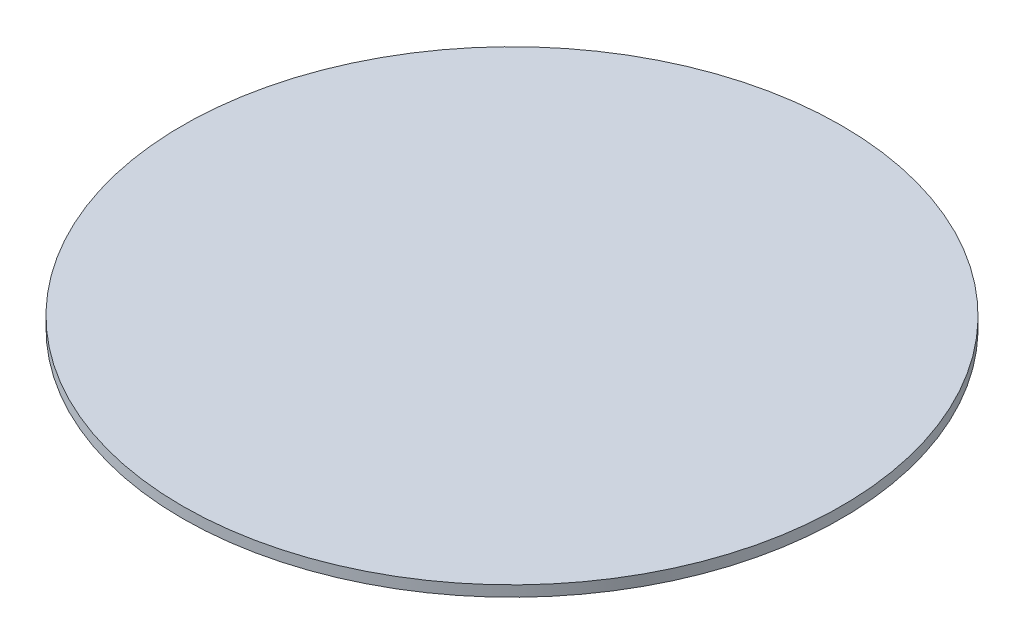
ISO-10303-21;
HEADER;
FILE_DESCRIPTION(('STEP AP214'),'2;1');
FILE_NAME('part.step','',(''),(''),'','','');
FILE_SCHEMA(('AUTOMOTIVE_DESIGN { 1 0 10303 214 1 1 1 1 }'));
ENDSEC;
DATA;
#1=APPLICATION_CONTEXT('core data for automotive mechanical design processes');
#2=APPLICATION_PROTOCOL_DEFINITION('international standard','automotive_design',2000,#1);
#3=PRODUCT_CONTEXT('',#1,'mechanical');
#4=PRODUCT('Part','Part','',(#3));
#5=PRODUCT_RELATED_PRODUCT_CATEGORY('part','',(#4));
#6=PRODUCT_DEFINITION_FORMATION('','',#4);
#7=PRODUCT_DEFINITION_CONTEXT('part definition',#1,'design');
#8=PRODUCT_DEFINITION('design','',#6,#7);
#9=PRODUCT_DEFINITION_SHAPE('','',#8);
#10=(LENGTH_UNIT() NAMED_UNIT(*) SI_UNIT(.MILLI.,.METRE.));
#11=(NAMED_UNIT(*) PLANE_ANGLE_UNIT() SI_UNIT($,.RADIAN.));
#12=(NAMED_UNIT(*) SI_UNIT($,.STERADIAN.) SOLID_ANGLE_UNIT());
#13=UNCERTAINTY_MEASURE_WITH_UNIT(LENGTH_MEASURE(1.E-05),#10,'distance_accuracy_value','');
#14=(GEOMETRIC_REPRESENTATION_CONTEXT(3) GLOBAL_UNCERTAINTY_ASSIGNED_CONTEXT((#13)) GLOBAL_UNIT_ASSIGNED_CONTEXT((#10,
#11,#12)) REPRESENTATION_CONTEXT('',''));
#15=CARTESIAN_POINT('',(0.,0.,0.));
#16=DIRECTION('',(0.,0.,1.));
#17=DIRECTION('',(1.,0.,0.));
#18=AXIS2_PLACEMENT_3D('',#15,#16,#17);
#19=CARTESIAN_POINT('',(-127.,0.,0.));
#20=DIRECTION('',(0.,1.,0.));
#21=DIRECTION('',(0.,0.,1.));
#22=AXIS2_PLACEMENT_3D('',#19,#20,#21);
#23=PLANE('',#22);
#24=CARTESIAN_POINT('',(0.,0.,0.));
#25=DIRECTION('',(0.,-1.,0.));
#26=DIRECTION('',(0.,0.,-1.));
#27=AXIS2_PLACEMENT_3D('',#24,#25,#26);
#28=CIRCLE('',#27,127.);
#29=CARTESIAN_POINT('',(0.,0.,-127.));
#30=VERTEX_POINT('',#29);
#31=EDGE_CURVE('E56',#30,#30,#28,.T.);
#32=ORIENTED_EDGE('',*,*,#31,.F.);
#33=EDGE_LOOP('',(#32));
#34=FACE_BOUND('',#33,.T.);
#35=CARTESIAN_POINT('',(0.,0.,0.));
#36=DIRECTION('',(0.,-1.,0.));
#37=DIRECTION('',(0.,0.,-1.));
#38=AXIS2_PLACEMENT_3D('',#35,#36,#37);
#39=CIRCLE('',#38,155.575);
#40=CARTESIAN_POINT('',(0.,0.,-155.575));
#41=VERTEX_POINT('',#40);
#42=EDGE_CURVE('E10',#41,#41,#39,.T.);
#43=ORIENTED_EDGE('',*,*,#42,.T.);
#44=EDGE_LOOP('',(#43));
#45=FACE_BOUND('',#44,.T.);
#46=ADVANCED_FACE('F31',(#34,#45),#23,.F.);
#47=CARTESIAN_POINT('',(0.,0.,0.));
#48=DIRECTION('',(0.,-1.,0.));
#49=DIRECTION('',(0.,0.,-1.));
#50=AXIS2_PLACEMENT_3D('',#47,#48,#49);
#51=CYLINDRICAL_SURFACE('',#50,155.575);
#52=ORIENTED_EDGE('',*,*,#42,.F.);
#53=EDGE_LOOP('',(#52));
#54=FACE_BOUND('',#53,.T.);
#55=CARTESIAN_POINT('',(0.,5.08,0.));
#56=DIRECTION('',(0.,-1.,0.));
#57=DIRECTION('',(0.,0.,-1.));
#58=AXIS2_PLACEMENT_3D('',#55,#56,#57);
#59=CIRCLE('',#58,155.575);
#60=CARTESIAN_POINT('',(0.,5.08,-155.575));
#61=VERTEX_POINT('',#60);
#62=EDGE_CURVE('E37',#61,#61,#59,.T.);
#63=ORIENTED_EDGE('',*,*,#62,.T.);
#64=EDGE_LOOP('',(#63));
#65=FACE_BOUND('',#64,.T.);
#66=ADVANCED_FACE('F63',(#54,#65),#51,.T.);
#67=CARTESIAN_POINT('',(-155.575,5.08,0.));
#68=DIRECTION('',(0.,-1.,0.));
#69=DIRECTION('',(0.,0.,-1.));
#70=AXIS2_PLACEMENT_3D('',#67,#68,#69);
#71=PLANE('',#70);
#72=ORIENTED_EDGE('',*,*,#62,.F.);
#73=EDGE_LOOP('',(#72));
#74=FACE_BOUND('',#73,.T.);
#75=ADVANCED_FACE('F67',(#74),#71,.F.);
#76=CARTESIAN_POINT('',(-109.22,0.,0.));
#77=DIRECTION('',(0.,1.,0.));
#78=DIRECTION('',(0.,0.,1.));
#79=AXIS2_PLACEMENT_3D('',#76,#77,#78);
#80=PLANE('',#79);
#81=CARTESIAN_POINT('',(0.,0.,0.));
#82=DIRECTION('',(0.,-1.,0.));
#83=DIRECTION('',(0.,0.,-1.));
#84=AXIS2_PLACEMENT_3D('',#81,#82,#83);
#85=CIRCLE('',#84,109.22);
#86=CARTESIAN_POINT('',(0.,0.,-109.22));
#87=VERTEX_POINT('',#86);
#88=EDGE_CURVE('E41',#87,#87,#85,.T.);
#89=ORIENTED_EDGE('',*,*,#88,.T.);
#90=EDGE_LOOP('',(#89));
#91=FACE_BOUND('',#90,.T.);
#92=ADVANCED_FACE('F72',(#91),#80,.F.);
#93=CARTESIAN_POINT('',(0.,-10.16,0.));
#94=DIRECTION('',(0.,-1.,0.));
#95=DIRECTION('',(0.,0.,-1.));
#96=AXIS2_PLACEMENT_3D('',#93,#94,#95);
#97=TOROIDAL_SURFACE('',#96,109.22,10.16);
#98=ORIENTED_EDGE('',*,*,#88,.F.);
#99=EDGE_LOOP('',(#98));
#100=FACE_BOUND('',#99,.T.);
#101=CARTESIAN_POINT('',(0.,-10.16,0.));
#102=DIRECTION('',(0.,-1.,0.));
#103=DIRECTION('',(0.,0.,-1.));
#104=AXIS2_PLACEMENT_3D('',#101,#102,#103);
#105=CIRCLE('',#104,119.38);
#106=CARTESIAN_POINT('',(0.,-10.16,-119.38));
#107=VERTEX_POINT('',#106);
#108=EDGE_CURVE('E45',#107,#107,#105,.T.);
#109=ORIENTED_EDGE('',*,*,#108,.T.);
#110=EDGE_LOOP('',(#109));
#111=FACE_BOUND('',#110,.T.);
#112=ADVANCED_FACE('F78',(#100,#111),#97,.F.);
#113=CARTESIAN_POINT('',(0.,0.,0.));
#114=DIRECTION('',(0.,-1.,0.));
#115=DIRECTION('',(0.,0.,-1.));
#116=AXIS2_PLACEMENT_3D('',#113,#114,#115);
#117=CYLINDRICAL_SURFACE('',#116,119.38);
#118=ORIENTED_EDGE('',*,*,#108,.F.);
#119=EDGE_LOOP('',(#118));
#120=FACE_BOUND('',#119,.T.);
#121=CARTESIAN_POINT('',(0.,-12.7,0.));
#122=DIRECTION('',(0.,-1.,0.));
#123=DIRECTION('',(0.,0.,-1.));
#124=AXIS2_PLACEMENT_3D('',#121,#122,#123);
#125=CIRCLE('',#124,119.38);
#126=CARTESIAN_POINT('',(0.,-12.7,-119.38));
#127=VERTEX_POINT('',#126);
#128=EDGE_CURVE('E50',#127,#127,#125,.T.);
#129=ORIENTED_EDGE('',*,*,#128,.T.);
#130=EDGE_LOOP('',(#129));
#131=FACE_BOUND('',#130,.T.);
#132=ADVANCED_FACE('F82',(#120,#131),#117,.F.);
#133=CARTESIAN_POINT('',(-119.38,-12.7,0.));
#134=DIRECTION('',(0.,1.,0.));
#135=DIRECTION('',(0.,0.,1.));
#136=AXIS2_PLACEMENT_3D('',#133,#134,#135);
#137=PLANE('',#136);
#138=ORIENTED_EDGE('',*,*,#128,.F.);
#139=EDGE_LOOP('',(#138));
#140=FACE_BOUND('',#139,.T.);
#141=CARTESIAN_POINT('',(0.,-12.7,0.));
#142=DIRECTION('',(0.,-1.,0.));
#143=DIRECTION('',(0.,0.,-1.));
#144=AXIS2_PLACEMENT_3D('',#141,#142,#143);
#145=CIRCLE('',#144,127.);
#146=CARTESIAN_POINT('',(0.,-12.7,-127.));
#147=VERTEX_POINT('',#146);
#148=EDGE_CURVE('E53',#147,#147,#145,.T.);
#149=ORIENTED_EDGE('',*,*,#148,.T.);
#150=EDGE_LOOP('',(#149));
#151=FACE_BOUND('',#150,.T.);
#152=ADVANCED_FACE('F86',(#140,#151),#137,.F.);
#153=CARTESIAN_POINT('',(0.,0.,0.));
#154=DIRECTION('',(0.,-1.,0.));
#155=DIRECTION('',(0.,0.,-1.));
#156=AXIS2_PLACEMENT_3D('',#153,#154,#155);
#157=CYLINDRICAL_SURFACE('',#156,127.);
#158=ORIENTED_EDGE('',*,*,#148,.F.);
#159=EDGE_LOOP('',(#158));
#160=FACE_BOUND('',#159,.T.);
#161=ORIENTED_EDGE('',*,*,#31,.T.);
#162=EDGE_LOOP('',(#161));
#163=FACE_BOUND('',#162,.T.);
#164=ADVANCED_FACE('F60',(#160,#163),#157,.T.);
#165=CLOSED_SHELL('',(#46,#66,#75,#92,#112,#132,#152,#164));
#166=MANIFOLD_SOLID_BREP('B2',#165);
#167=ADVANCED_BREP_SHAPE_REPRESENTATION('',(#18,#166),#14);
#168=SHAPE_DEFINITION_REPRESENTATION(#9,#167);
ENDSEC;
END-ISO-10303-21;
